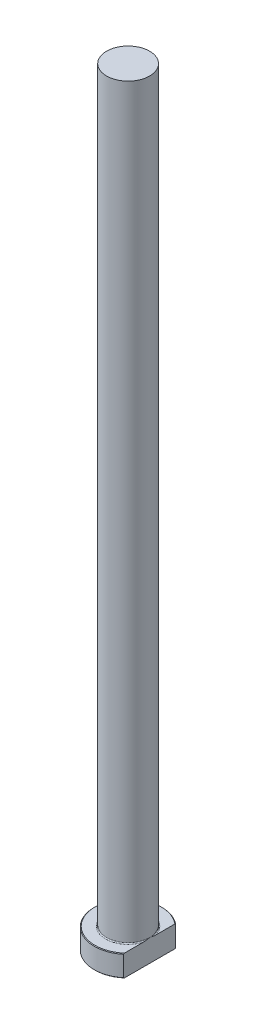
from build123d import *
from build123d.topology import SkipClean

# Parameters (mm, degrees)
CHAMFER1_SIZE = 0.2
FILLET1_R     = 0.3
KEY_DEPTH     = 251.483532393


with BuildPart() as part:
    # Sketch1 → Revolve1 (revolve)
    with BuildSketch(Plane.XY, mode=Mode.PRIVATE) as revolve1_sk:
        Polygon((0, 0), (-11, 0), (-11, 7), (-7, 7), (-7, 250), (0, 250), align=None)
    revolve(revolve1_sk.sketch.rotate(Axis((0, 259.958771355, 0), (0, -1, 0)), 270), axis=Axis((0, 259.958771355, 0), (0, -1, 0)))

    # Chamfer1
    chamfer1_edges = [part.edges().sort_by_distance(p)[0] for p in [
        (0, 7, -11),
        (0, 0, -11),
    ]]
    chamfer(chamfer1_edges, length=CHAMFER1_SIZE)

    # Fillet1
    fillet1_edges = [part.edges().sort_by_distance(p)[0] for p in [
        (0, 7, -7),
    ]]
    fillet(fillet1_edges, radius=FILLET1_R)

    # Sketch2 → KEY (cut, through all)
    with SkipClean():  # the faces are left unmerged after this step: merging them gives an invalid solid
        with BuildSketch(Plane(origin=(0, 0, 0), x_dir=(1, 0, 0), z_dir=(0, 1, 0))):
            with BuildLine():
                Line((7, 8.485281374), (7, -8.485281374))
                ThreePointArc((7, -8.485281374), (11, 0), (7, 8.485281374))
            make_face()
        extrude(amount=KEY_DEPTH, mode=Mode.SUBTRACT)


solid = part.part
